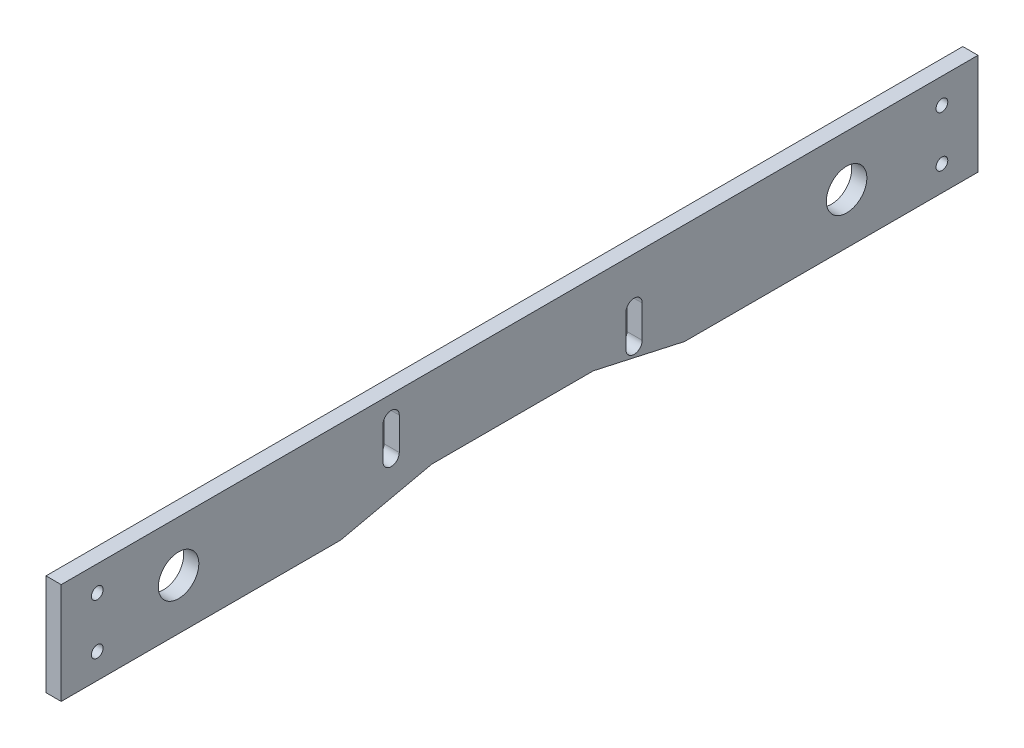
ISO-10303-21;
HEADER;
FILE_DESCRIPTION(('STEP AP214'),'2;1');
FILE_NAME('part.step','',(''),(''),'','','');
FILE_SCHEMA(('AUTOMOTIVE_DESIGN { 1 0 10303 214 1 1 1 1 }'));
ENDSEC;
DATA;
#1=APPLICATION_CONTEXT('core data for automotive mechanical design processes');
#2=APPLICATION_PROTOCOL_DEFINITION('international standard','automotive_design',2000,#1);
#3=PRODUCT_CONTEXT('',#1,'mechanical');
#4=PRODUCT('Part','Part','',(#3));
#5=PRODUCT_RELATED_PRODUCT_CATEGORY('part','',(#4));
#6=PRODUCT_DEFINITION_FORMATION('','',#4);
#7=PRODUCT_DEFINITION_CONTEXT('part definition',#1,'design');
#8=PRODUCT_DEFINITION('design','',#6,#7);
#9=PRODUCT_DEFINITION_SHAPE('','',#8);
#10=(LENGTH_UNIT() NAMED_UNIT(*) SI_UNIT(.MILLI.,.METRE.));
#11=(NAMED_UNIT(*) PLANE_ANGLE_UNIT() SI_UNIT($,.RADIAN.));
#12=(NAMED_UNIT(*) SI_UNIT($,.STERADIAN.) SOLID_ANGLE_UNIT());
#13=UNCERTAINTY_MEASURE_WITH_UNIT(LENGTH_MEASURE(1.E-05),#10,'distance_accuracy_value','');
#14=(GEOMETRIC_REPRESENTATION_CONTEXT(3) GLOBAL_UNCERTAINTY_ASSIGNED_CONTEXT((#13)) GLOBAL_UNIT_ASSIGNED_CONTEXT((#10,
#11,#12)) REPRESENTATION_CONTEXT('',''));
#15=CARTESIAN_POINT('',(0.,0.,0.));
#16=DIRECTION('',(0.,0.,1.));
#17=DIRECTION('',(1.,0.,0.));
#18=AXIS2_PLACEMENT_3D('',#15,#16,#17);
#19=CARTESIAN_POINT('',(4.7625,-15.875,143.79575));
#20=DIRECTION('',(0.,1.,0.));
#21=DIRECTION('',(0.,0.,1.));
#22=AXIS2_PLACEMENT_3D('',#19,#20,#21);
#23=PLANE('',#22);
#24=DIRECTION('',(0.,0.,-1.));
#25=VECTOR('',#24,1.);
#26=CARTESIAN_POINT('',(4.7625,-15.875,143.79575));
#27=LINE('',#26,#25);
#28=CARTESIAN_POINT('',(4.7625,-15.875,-51.78425));
#29=VERTEX_POINT('',#28);
#30=CARTESIAN_POINT('',(4.7625,-15.875,-143.79575));
#31=VERTEX_POINT('',#30);
#32=EDGE_CURVE('E176',#29,#31,#27,.T.);
#33=ORIENTED_EDGE('',*,*,#32,.F.);
#34=DIRECTION('',(-1.,0.,0.));
#35=VECTOR('',#34,1.);
#36=CARTESIAN_POINT('',(4.7625,-15.875,-51.78425));
#37=LINE('',#36,#35);
#38=CARTESIAN_POINT('',(0.,-15.875,-51.78425));
#39=VERTEX_POINT('',#38);
#40=EDGE_CURVE('E216',#29,#39,#37,.T.);
#41=ORIENTED_EDGE('',*,*,#40,.T.);
#42=DIRECTION('',(0.,0.,-1.));
#43=VECTOR('',#42,1.);
#44=CARTESIAN_POINT('',(0.,-15.875,143.79575));
#45=LINE('',#44,#43);
#46=CARTESIAN_POINT('',(0.,-15.875,-143.79575));
#47=VERTEX_POINT('',#46);
#48=EDGE_CURVE('E192',#39,#47,#45,.T.);
#49=ORIENTED_EDGE('',*,*,#48,.T.);
#50=DIRECTION('',(-1.,0.,0.));
#51=VECTOR('',#50,1.);
#52=CARTESIAN_POINT('',(4.7625,-15.875,-143.79575));
#53=LINE('',#52,#51);
#54=EDGE_CURVE('E175',#31,#47,#53,.T.);
#55=ORIENTED_EDGE('',*,*,#54,.F.);
#56=EDGE_LOOP('',(#33,#41,#49,#55));
#57=FACE_BOUND('',#56,.T.);
#58=ADVANCED_FACE('F39',(#57),#23,.F.);
#59=CARTESIAN_POINT('',(4.7625,-15.875,-143.79575));
#60=DIRECTION('',(0.,0.,1.));
#61=DIRECTION('',(1.,0.,0.));
#62=AXIS2_PLACEMENT_3D('',#59,#60,#61);
#63=PLANE('',#62);
#64=DIRECTION('',(0.,1.,0.));
#65=VECTOR('',#64,1.);
#66=CARTESIAN_POINT('',(0.,-15.875,-143.79575));
#67=LINE('',#66,#65);
#68=CARTESIAN_POINT('',(0.,15.875,-143.79575));
#69=VERTEX_POINT('',#68);
#70=EDGE_CURVE('E184',#47,#69,#67,.T.);
#71=ORIENTED_EDGE('',*,*,#70,.T.);
#72=DIRECTION('',(-1.,0.,0.));
#73=VECTOR('',#72,1.);
#74=CARTESIAN_POINT('',(4.7625,15.875,-143.79575));
#75=LINE('',#74,#73);
#76=CARTESIAN_POINT('',(4.7625,15.875,-143.79575));
#77=VERTEX_POINT('',#76);
#78=EDGE_CURVE('E11',#77,#69,#75,.T.);
#79=ORIENTED_EDGE('',*,*,#78,.F.);
#80=DIRECTION('',(0.,1.,0.));
#81=VECTOR('',#80,1.);
#82=CARTESIAN_POINT('',(4.7625,-15.875,-143.79575));
#83=LINE('',#82,#81);
#84=EDGE_CURVE('E193',#31,#77,#83,.T.);
#85=ORIENTED_EDGE('',*,*,#84,.F.);
#86=ORIENTED_EDGE('',*,*,#54,.T.);
#87=EDGE_LOOP('',(#71,#79,#85,#86));
#88=FACE_BOUND('',#87,.T.);
#89=ADVANCED_FACE('F41',(#88),#63,.F.);
#90=CARTESIAN_POINT('',(4.7625,15.875,143.79575));
#91=DIRECTION('',(0.,-1.,0.));
#92=DIRECTION('',(0.,0.,-1.));
#93=AXIS2_PLACEMENT_3D('',#90,#91,#92);
#94=PLANE('',#93);
#95=DIRECTION('',(0.,0.,1.));
#96=VECTOR('',#95,1.);
#97=CARTESIAN_POINT('',(0.,15.875,143.79575));
#98=LINE('',#97,#96);
#99=CARTESIAN_POINT('',(0.,15.875,143.79575));
#100=VERTEX_POINT('',#99);
#101=EDGE_CURVE('E187',#69,#100,#98,.T.);
#102=ORIENTED_EDGE('',*,*,#101,.T.);
#103=DIRECTION('',(-1.,0.,0.));
#104=VECTOR('',#103,1.);
#105=CARTESIAN_POINT('',(4.7625,15.875,143.79575));
#106=LINE('',#105,#104);
#107=CARTESIAN_POINT('',(4.7625,15.875,143.79575));
#108=VERTEX_POINT('',#107);
#109=EDGE_CURVE('E47',#108,#100,#106,.T.);
#110=ORIENTED_EDGE('',*,*,#109,.F.);
#111=DIRECTION('',(0.,0.,1.));
#112=VECTOR('',#111,1.);
#113=CARTESIAN_POINT('',(4.7625,15.875,143.79575));
#114=LINE('',#113,#112);
#115=EDGE_CURVE('E320',#77,#108,#114,.T.);
#116=ORIENTED_EDGE('',*,*,#115,.F.);
#117=ORIENTED_EDGE('',*,*,#78,.T.);
#118=EDGE_LOOP('',(#102,#110,#116,#117));
#119=FACE_BOUND('',#118,.T.);
#120=ADVANCED_FACE('F323',(#119),#94,.F.);
#121=CARTESIAN_POINT('',(4.7625,-15.875,143.79575));
#122=DIRECTION('',(0.,0.,-1.));
#123=DIRECTION('',(-1.,0.,0.));
#124=AXIS2_PLACEMENT_3D('',#121,#122,#123);
#125=PLANE('',#124);
#126=DIRECTION('',(0.,-1.,0.));
#127=VECTOR('',#126,1.);
#128=CARTESIAN_POINT('',(0.,-15.875,143.79575));
#129=LINE('',#128,#127);
#130=CARTESIAN_POINT('',(0.,-15.875,143.79575));
#131=VERTEX_POINT('',#130);
#132=EDGE_CURVE('E190',#100,#131,#129,.T.);
#133=ORIENTED_EDGE('',*,*,#132,.T.);
#134=DIRECTION('',(-1.,0.,0.));
#135=VECTOR('',#134,1.);
#136=CARTESIAN_POINT('',(4.7625,-15.875,143.79575));
#137=LINE('',#136,#135);
#138=CARTESIAN_POINT('',(4.7625,-15.875,143.79575));
#139=VERTEX_POINT('',#138);
#140=EDGE_CURVE('E179',#139,#131,#137,.T.);
#141=ORIENTED_EDGE('',*,*,#140,.F.);
#142=DIRECTION('',(0.,-1.,0.));
#143=VECTOR('',#142,1.);
#144=CARTESIAN_POINT('',(4.7625,-15.875,143.79575));
#145=LINE('',#144,#143);
#146=EDGE_CURVE('E173',#108,#139,#145,.T.);
#147=ORIENTED_EDGE('',*,*,#146,.F.);
#148=ORIENTED_EDGE('',*,*,#109,.T.);
#149=EDGE_LOOP('',(#133,#141,#147,#148));
#150=FACE_BOUND('',#149,.T.);
#151=ADVANCED_FACE('F199',(#150),#125,.F.);
#152=CARTESIAN_POINT('',(0.,-15.875,56.1657500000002));
#153=VERTEX_POINT('',#152);
#154=EDGE_CURVE('E168',#131,#153,#45,.T.);
#155=ORIENTED_EDGE('',*,*,#154,.T.);
#156=DIRECTION('',(-1.,0.,0.));
#157=VECTOR('',#156,1.);
#158=CARTESIAN_POINT('',(4.7625,-15.875,56.16575));
#159=LINE('',#158,#157);
#160=CARTESIAN_POINT('',(4.7625,-15.875,56.16575));
#161=VERTEX_POINT('',#160);
#162=EDGE_CURVE('E54',#161,#153,#159,.T.);
#163=ORIENTED_EDGE('',*,*,#162,.F.);
#164=EDGE_CURVE('E166',#139,#161,#27,.T.);
#165=ORIENTED_EDGE('',*,*,#164,.F.);
#166=ORIENTED_EDGE('',*,*,#140,.T.);
#167=EDGE_LOOP('',(#155,#163,#165,#166));
#168=FACE_BOUND('',#167,.T.);
#169=ADVANCED_FACE('F164',(#168),#23,.F.);
#170=CARTESIAN_POINT('',(4.7625,0.,0.));
#171=DIRECTION('',(-1.,0.,0.));
#172=DIRECTION('',(0.,0.,1.));
#173=AXIS2_PLACEMENT_3D('',#170,#171,#172);
#174=PLANE('',#173);
#175=DIRECTION('',(0.,1.,0.));
#176=VECTOR('',#175,1.);
#177=CARTESIAN_POINT('',(4.7625,-1.27000000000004,42.84345));
#178=LINE('',#177,#176);
#179=CARTESIAN_POINT('',(4.7625,-1.27000000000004,42.84345));
#180=VERTEX_POINT('',#179);
#181=CARTESIAN_POINT('',(4.7625,8.88999999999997,42.84345));
#182=VERTEX_POINT('',#181);
#183=EDGE_CURVE('E231',#180,#182,#178,.T.);
#184=ORIENTED_EDGE('',*,*,#183,.T.);
#185=CARTESIAN_POINT('',(4.7625,8.88999999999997,40.29075));
#186=DIRECTION('',(-1.,0.,0.));
#187=DIRECTION('',(0.,0.,1.));
#188=AXIS2_PLACEMENT_3D('',#185,#186,#187);
#189=CIRCLE('',#188,2.55269999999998);
#190=CARTESIAN_POINT('',(4.7625,8.88999999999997,37.7380500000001));
#191=VERTEX_POINT('',#190);
#192=EDGE_CURVE('E223',#182,#191,#189,.T.);
#193=ORIENTED_EDGE('',*,*,#192,.T.);
#194=DIRECTION('',(0.,-1.,0.));
#195=VECTOR('',#194,1.);
#196=CARTESIAN_POINT('',(4.7625,8.88999999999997,37.7380500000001));
#197=LINE('',#196,#195);
#198=CARTESIAN_POINT('',(4.7625,-1.27000000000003,37.7380500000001));
#199=VERTEX_POINT('',#198);
#200=EDGE_CURVE('E226',#191,#199,#197,.T.);
#201=ORIENTED_EDGE('',*,*,#200,.T.);
#202=CARTESIAN_POINT('',(4.7625,-1.27000000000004,40.29075));
#203=DIRECTION('',(-1.,0.,0.));
#204=DIRECTION('',(0.,0.,1.));
#205=AXIS2_PLACEMENT_3D('',#202,#203,#204);
#206=CIRCLE('',#205,2.55269999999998);
#207=EDGE_CURVE('E62',#199,#180,#206,.T.);
#208=ORIENTED_EDGE('',*,*,#207,.T.);
#209=EDGE_LOOP('',(#184,#193,#201,#208));
#210=FACE_BOUND('',#209,.T.);
#211=DIRECTION('',(0.,1.,0.));
#212=VECTOR('',#211,1.);
#213=CARTESIAN_POINT('',(4.7625,-8.89000000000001,-33.35655));
#214=LINE('',#213,#212);
#215=CARTESIAN_POINT('',(4.7625,-8.89000000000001,-33.35655));
#216=VERTEX_POINT('',#215);
#217=CARTESIAN_POINT('',(4.7625,1.26999999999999,-33.35655));
#218=VERTEX_POINT('',#217);
#219=EDGE_CURVE('E265',#216,#218,#214,.T.);
#220=ORIENTED_EDGE('',*,*,#219,.T.);
#221=CARTESIAN_POINT('',(4.7625,1.26999999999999,-35.90925));
#222=DIRECTION('',(-1.,0.,0.));
#223=DIRECTION('',(0.,0.,1.));
#224=AXIS2_PLACEMENT_3D('',#221,#222,#223);
#225=CIRCLE('',#224,2.55269999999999);
#226=CARTESIAN_POINT('',(4.7625,1.26999999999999,-38.46195));
#227=VERTEX_POINT('',#226);
#228=EDGE_CURVE('E255',#218,#227,#225,.T.);
#229=ORIENTED_EDGE('',*,*,#228,.T.);
#230=DIRECTION('',(0.,-1.,0.));
#231=VECTOR('',#230,1.);
#232=CARTESIAN_POINT('',(4.7625,1.26999999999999,-38.46195));
#233=LINE('',#232,#231);
#234=CARTESIAN_POINT('',(4.7625,-8.89000000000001,-38.46195));
#235=VERTEX_POINT('',#234);
#236=EDGE_CURVE('E258',#227,#235,#233,.T.);
#237=ORIENTED_EDGE('',*,*,#236,.T.);
#238=CARTESIAN_POINT('',(4.7625,-8.89000000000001,-35.90925));
#239=DIRECTION('',(-1.,0.,0.));
#240=DIRECTION('',(0.,0.,1.));
#241=AXIS2_PLACEMENT_3D('',#238,#239,#240);
#242=CIRCLE('',#241,2.55269999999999);
#243=EDGE_CURVE('E262',#235,#216,#242,.T.);
#244=ORIENTED_EDGE('',*,*,#243,.T.);
#245=EDGE_LOOP('',(#220,#229,#237,#244));
#246=FACE_BOUND('',#245,.T.);
#247=CARTESIAN_POINT('',(4.7625,7.93750000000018,132.4737));
#248=DIRECTION('',(-1.,0.,0.));
#249=DIRECTION('',(0.,0.,-1.));
#250=AXIS2_PLACEMENT_3D('',#247,#248,#249);
#251=CIRCLE('',#250,1.84149999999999);
#252=CARTESIAN_POINT('',(4.7625,7.93750000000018,134.3152));
#253=VERTEX_POINT('',#252);
#254=EDGE_CURVE('E298',#253,#253,#251,.T.);
#255=ORIENTED_EDGE('',*,*,#254,.T.);
#256=EDGE_LOOP('',(#255));
#257=FACE_BOUND('',#256,.T.);
#258=CARTESIAN_POINT('',(4.7625,-7.93749999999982,132.4737));
#259=DIRECTION('',(-1.,0.,0.));
#260=DIRECTION('',(0.,0.,-1.));
#261=AXIS2_PLACEMENT_3D('',#258,#259,#260);
#262=CIRCLE('',#261,1.84149999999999);
#263=CARTESIAN_POINT('',(4.7625,-7.93749999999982,134.3152));
#264=VERTEX_POINT('',#263);
#265=EDGE_CURVE('E292',#264,#264,#262,.T.);
#266=ORIENTED_EDGE('',*,*,#265,.T.);
#267=EDGE_LOOP('',(#266));
#268=FACE_BOUND('',#267,.T.);
#269=CARTESIAN_POINT('',(4.7625,-7.93749999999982,-132.4737));
#270=DIRECTION('',(-1.,0.,0.));
#271=DIRECTION('',(0.,0.,1.));
#272=AXIS2_PLACEMENT_3D('',#269,#270,#271);
#273=CIRCLE('',#272,1.84149999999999);
#274=CARTESIAN_POINT('',(4.7625,-7.93749999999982,-130.6322));
#275=VERTEX_POINT('',#274);
#276=EDGE_CURVE('E285',#275,#275,#273,.T.);
#277=ORIENTED_EDGE('',*,*,#276,.T.);
#278=EDGE_LOOP('',(#277));
#279=FACE_BOUND('',#278,.T.);
#280=CARTESIAN_POINT('',(4.7625,7.93750000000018,-132.4737));
#281=DIRECTION('',(-1.,0.,0.));
#282=DIRECTION('',(0.,0.,1.));
#283=AXIS2_PLACEMENT_3D('',#280,#281,#282);
#284=CIRCLE('',#283,1.84149999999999);
#285=CARTESIAN_POINT('',(4.7625,7.93750000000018,-130.6322));
#286=VERTEX_POINT('',#285);
#287=EDGE_CURVE('E303',#286,#286,#284,.T.);
#288=ORIENTED_EDGE('',*,*,#287,.T.);
#289=EDGE_LOOP('',(#288));
#290=FACE_BOUND('',#289,.T.);
#291=CARTESIAN_POINT('',(4.7625,0.,106.96575));
#292=DIRECTION('',(1.,0.,0.));
#293=DIRECTION('',(0.,0.,-1.));
#294=AXIS2_PLACEMENT_3D('',#291,#292,#293);
#295=CIRCLE('',#294,6.35);
#296=CARTESIAN_POINT('',(4.7625,0.,100.61575));
#297=VERTEX_POINT('',#296);
#298=EDGE_CURVE('E311',#297,#297,#295,.T.);
#299=ORIENTED_EDGE('',*,*,#298,.F.);
#300=EDGE_LOOP('',(#299));
#301=FACE_BOUND('',#300,.T.);
#302=CARTESIAN_POINT('',(4.7625,0.,-102.58425));
#303=DIRECTION('',(1.,0.,0.));
#304=DIRECTION('',(0.,0.,-1.));
#305=AXIS2_PLACEMENT_3D('',#302,#303,#304);
#306=CIRCLE('',#305,6.35);
#307=CARTESIAN_POINT('',(4.7625,0.,-108.93425));
#308=VERTEX_POINT('',#307);
#309=EDGE_CURVE('E306',#308,#308,#306,.T.);
#310=ORIENTED_EDGE('',*,*,#309,.F.);
#311=EDGE_LOOP('',(#310));
#312=FACE_BOUND('',#311,.T.);
#313=DIRECTION('',(0.,0.,-1.));
#314=VECTOR('',#313,1.);
#315=CARTESIAN_POINT('',(4.7625,-9.52500000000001,-23.1412510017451));
#316=LINE('',#315,#314);
#317=CARTESIAN_POINT('',(4.7625,-9.52500000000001,27.5227510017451));
#318=VERTEX_POINT('',#317);
#319=CARTESIAN_POINT('',(4.7625,-9.52500000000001,-23.1412510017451));
#320=VERTEX_POINT('',#319);
#321=EDGE_CURVE('E158',#318,#320,#316,.T.);
#322=ORIENTED_EDGE('',*,*,#321,.T.);
#323=DIRECTION('',(0.,-0.216439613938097,-0.976296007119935));
#324=VECTOR('',#323,1.);
#325=CARTESIAN_POINT('',(4.7625,-15.875,-51.78425));
#326=LINE('',#325,#324);
#327=EDGE_CURVE('E169',#320,#29,#326,.T.);
#328=ORIENTED_EDGE('',*,*,#327,.T.);
#329=ORIENTED_EDGE('',*,*,#32,.T.);
#330=ORIENTED_EDGE('',*,*,#84,.T.);
#331=ORIENTED_EDGE('',*,*,#115,.T.);
#332=ORIENTED_EDGE('',*,*,#146,.T.);
#333=ORIENTED_EDGE('',*,*,#164,.T.);
#334=DIRECTION('',(0.,0.216439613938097,-0.976296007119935));
#335=VECTOR('',#334,1.);
#336=CARTESIAN_POINT('',(4.7625,-9.52500000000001,27.5227510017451));
#337=LINE('',#336,#335);
#338=EDGE_CURVE('E151',#161,#318,#337,.T.);
#339=ORIENTED_EDGE('',*,*,#338,.T.);
#340=EDGE_LOOP('',(#322,#328,#329,#330,#331,#332,#333,#339));
#341=FACE_BOUND('',#340,.T.);
#342=ADVANCED_FACE('F171',(#210,#246,#257,#268,#279,#290,#301,#312,#341),#174,.F.);
#343=CARTESIAN_POINT('',(0.,0.,0.));
#344=DIRECTION('',(-1.,0.,0.));
#345=DIRECTION('',(0.,0.,1.));
#346=AXIS2_PLACEMENT_3D('',#343,#344,#345);
#347=PLANE('',#346);
#348=DIRECTION('',(0.,-0.216439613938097,-0.976296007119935));
#349=VECTOR('',#348,1.);
#350=CARTESIAN_POINT('',(0.,-15.875,-51.78425));
#351=LINE('',#350,#349);
#352=CARTESIAN_POINT('',(0.,-9.52500000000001,-23.1412510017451));
#353=VERTEX_POINT('',#352);
#354=EDGE_CURVE('E159',#353,#39,#351,.T.);
#355=ORIENTED_EDGE('',*,*,#354,.F.);
#356=DIRECTION('',(0.,0.,-1.));
#357=VECTOR('',#356,1.);
#358=CARTESIAN_POINT('',(0.,-9.52500000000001,-23.1412510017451));
#359=LINE('',#358,#357);
#360=CARTESIAN_POINT('',(0.,-9.52500000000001,27.5227510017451));
#361=VERTEX_POINT('',#360);
#362=EDGE_CURVE('E209',#361,#353,#359,.T.);
#363=ORIENTED_EDGE('',*,*,#362,.F.);
#364=DIRECTION('',(0.,0.216439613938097,-0.976296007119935));
#365=VECTOR('',#364,1.);
#366=CARTESIAN_POINT('',(0.,-9.52500000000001,27.5227510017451));
#367=LINE('',#366,#365);
#368=EDGE_CURVE('E207',#153,#361,#367,.T.);
#369=ORIENTED_EDGE('',*,*,#368,.F.);
#370=ORIENTED_EDGE('',*,*,#154,.F.);
#371=ORIENTED_EDGE('',*,*,#132,.F.);
#372=ORIENTED_EDGE('',*,*,#101,.F.);
#373=ORIENTED_EDGE('',*,*,#70,.F.);
#374=ORIENTED_EDGE('',*,*,#48,.F.);
#375=EDGE_LOOP('',(#355,#363,#369,#370,#371,#372,#373,#374));
#376=FACE_BOUND('',#375,.T.);
#377=CARTESIAN_POINT('',(0.,8.88999999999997,40.29075));
#378=DIRECTION('',(-1.,0.,0.));
#379=DIRECTION('',(0.,0.,1.));
#380=AXIS2_PLACEMENT_3D('',#377,#378,#379);
#381=CIRCLE('',#380,2.55269999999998);
#382=CARTESIAN_POINT('',(0.,8.88999999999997,42.84345));
#383=VERTEX_POINT('',#382);
#384=CARTESIAN_POINT('',(0.,8.88999999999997,37.7380500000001));
#385=VERTEX_POINT('',#384);
#386=EDGE_CURVE('E235',#383,#385,#381,.T.);
#387=ORIENTED_EDGE('',*,*,#386,.F.);
#388=DIRECTION('',(0.,1.,0.));
#389=VECTOR('',#388,1.);
#390=CARTESIAN_POINT('',(0.,-1.27000000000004,42.84345));
#391=LINE('',#390,#389);
#392=CARTESIAN_POINT('',(0.,-1.27000000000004,42.84345));
#393=VERTEX_POINT('',#392);
#394=EDGE_CURVE('E227',#393,#383,#391,.T.);
#395=ORIENTED_EDGE('',*,*,#394,.F.);
#396=CARTESIAN_POINT('',(0.,-1.27000000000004,40.29075));
#397=DIRECTION('',(-1.,0.,0.));
#398=DIRECTION('',(0.,0.,1.));
#399=AXIS2_PLACEMENT_3D('',#396,#397,#398);
#400=CIRCLE('',#399,2.55269999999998);
#401=CARTESIAN_POINT('',(0.,-1.27000000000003,37.7380500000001));
#402=VERTEX_POINT('',#401);
#403=EDGE_CURVE('E241',#402,#393,#400,.T.);
#404=ORIENTED_EDGE('',*,*,#403,.F.);
#405=DIRECTION('',(0.,-1.,0.));
#406=VECTOR('',#405,1.);
#407=CARTESIAN_POINT('',(0.,8.88999999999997,37.7380500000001));
#408=LINE('',#407,#406);
#409=EDGE_CURVE('E237',#385,#402,#408,.T.);
#410=ORIENTED_EDGE('',*,*,#409,.F.);
#411=EDGE_LOOP('',(#387,#395,#404,#410));
#412=FACE_BOUND('',#411,.T.);
#413=CARTESIAN_POINT('',(0.,1.26999999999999,-35.90925));
#414=DIRECTION('',(-1.,0.,0.));
#415=DIRECTION('',(0.,0.,1.));
#416=AXIS2_PLACEMENT_3D('',#413,#414,#415);
#417=CIRCLE('',#416,2.55269999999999);
#418=CARTESIAN_POINT('',(0.,1.26999999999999,-33.35655));
#419=VERTEX_POINT('',#418);
#420=CARTESIAN_POINT('',(0.,1.26999999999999,-38.46195));
#421=VERTEX_POINT('',#420);
#422=EDGE_CURVE('E219',#419,#421,#417,.T.);
#423=ORIENTED_EDGE('',*,*,#422,.F.);
#424=DIRECTION('',(0.,1.,0.));
#425=VECTOR('',#424,1.);
#426=CARTESIAN_POINT('',(0.,-8.89000000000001,-33.35655));
#427=LINE('',#426,#425);
#428=CARTESIAN_POINT('',(0.,-8.89000000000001,-33.35655));
#429=VERTEX_POINT('',#428);
#430=EDGE_CURVE('E259',#429,#419,#427,.T.);
#431=ORIENTED_EDGE('',*,*,#430,.F.);
#432=CARTESIAN_POINT('',(0.,-8.89000000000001,-35.90925));
#433=DIRECTION('',(-1.,0.,0.));
#434=DIRECTION('',(0.,0.,1.));
#435=AXIS2_PLACEMENT_3D('',#432,#433,#434);
#436=CIRCLE('',#435,2.55269999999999);
#437=CARTESIAN_POINT('',(0.,-8.89000000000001,-38.46195));
#438=VERTEX_POINT('',#437);
#439=EDGE_CURVE('E273',#438,#429,#436,.T.);
#440=ORIENTED_EDGE('',*,*,#439,.F.);
#441=DIRECTION('',(0.,-1.,0.));
#442=VECTOR('',#441,1.);
#443=CARTESIAN_POINT('',(0.,1.26999999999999,-38.46195));
#444=LINE('',#443,#442);
#445=EDGE_CURVE('E270',#421,#438,#444,.T.);
#446=ORIENTED_EDGE('',*,*,#445,.F.);
#447=EDGE_LOOP('',(#423,#431,#440,#446));
#448=FACE_BOUND('',#447,.T.);
#449=CARTESIAN_POINT('',(0.,7.93750000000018,132.4737));
#450=DIRECTION('',(-1.,0.,0.));
#451=DIRECTION('',(0.,0.,-1.));
#452=AXIS2_PLACEMENT_3D('',#449,#450,#451);
#453=CIRCLE('',#452,1.84149999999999);
#454=CARTESIAN_POINT('',(0.,7.93750000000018,134.3152));
#455=VERTEX_POINT('',#454);
#456=EDGE_CURVE('E248',#455,#455,#453,.T.);
#457=ORIENTED_EDGE('',*,*,#456,.F.);
#458=EDGE_LOOP('',(#457));
#459=FACE_BOUND('',#458,.T.);
#460=CARTESIAN_POINT('',(0.,-7.93749999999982,132.4737));
#461=DIRECTION('',(-1.,0.,0.));
#462=DIRECTION('',(0.,0.,-1.));
#463=AXIS2_PLACEMENT_3D('',#460,#461,#462);
#464=CIRCLE('',#463,1.84149999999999);
#465=CARTESIAN_POINT('',(0.,-7.93749999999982,134.3152));
#466=VERTEX_POINT('',#465);
#467=EDGE_CURVE('E295',#466,#466,#464,.T.);
#468=ORIENTED_EDGE('',*,*,#467,.F.);
#469=EDGE_LOOP('',(#468));
#470=FACE_BOUND('',#469,.T.);
#471=CARTESIAN_POINT('',(0.,-7.93749999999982,-132.4737));
#472=DIRECTION('',(-1.,0.,0.));
#473=DIRECTION('',(0.,0.,1.));
#474=AXIS2_PLACEMENT_3D('',#471,#472,#473);
#475=CIRCLE('',#474,1.84149999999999);
#476=CARTESIAN_POINT('',(0.,-7.93749999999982,-130.6322));
#477=VERTEX_POINT('',#476);
#478=EDGE_CURVE('E289',#477,#477,#475,.T.);
#479=ORIENTED_EDGE('',*,*,#478,.F.);
#480=EDGE_LOOP('',(#479));
#481=FACE_BOUND('',#480,.T.);
#482=CARTESIAN_POINT('',(0.,7.93750000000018,-132.4737));
#483=DIRECTION('',(-1.,0.,0.));
#484=DIRECTION('',(0.,0.,1.));
#485=AXIS2_PLACEMENT_3D('',#482,#483,#484);
#486=CIRCLE('',#485,1.84149999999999);
#487=CARTESIAN_POINT('',(0.,7.93750000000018,-130.6322));
#488=VERTEX_POINT('',#487);
#489=EDGE_CURVE('E288',#488,#488,#486,.T.);
#490=ORIENTED_EDGE('',*,*,#489,.F.);
#491=EDGE_LOOP('',(#490));
#492=FACE_BOUND('',#491,.T.);
#493=CARTESIAN_POINT('',(0.,0.,106.96575));
#494=DIRECTION('',(1.,0.,0.));
#495=DIRECTION('',(0.,0.,-1.));
#496=AXIS2_PLACEMENT_3D('',#493,#494,#495);
#497=CIRCLE('',#496,6.35);
#498=CARTESIAN_POINT('',(0.,0.,100.61575));
#499=VERTEX_POINT('',#498);
#500=EDGE_CURVE('E188',#499,#499,#497,.T.);
#501=ORIENTED_EDGE('',*,*,#500,.T.);
#502=EDGE_LOOP('',(#501));
#503=FACE_BOUND('',#502,.T.);
#504=CARTESIAN_POINT('',(0.,0.,-102.58425));
#505=DIRECTION('',(1.,0.,0.));
#506=DIRECTION('',(0.,0.,-1.));
#507=AXIS2_PLACEMENT_3D('',#504,#505,#506);
#508=CIRCLE('',#507,6.35);
#509=CARTESIAN_POINT('',(0.,0.,-108.93425));
#510=VERTEX_POINT('',#509);
#511=EDGE_CURVE('E314',#510,#510,#508,.T.);
#512=ORIENTED_EDGE('',*,*,#511,.T.);
#513=EDGE_LOOP('',(#512));
#514=FACE_BOUND('',#513,.T.);
#515=ADVANCED_FACE('F203',(#376,#412,#448,#459,#470,#481,#492,#503,#514),#347,.T.);
#516=CARTESIAN_POINT('',(0.,0.,-102.58425));
#517=DIRECTION('',(1.,0.,0.));
#518=DIRECTION('',(0.,0.,-1.));
#519=AXIS2_PLACEMENT_3D('',#516,#517,#518);
#520=CYLINDRICAL_SURFACE('',#519,6.35);
#521=CARTESIAN_POINT('',(0.,0.,-108.93425));
#522=CARTESIAN_POINT('',(0.049609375,0.,-108.93425));
#523=CARTESIAN_POINT('',(0.09921875,0.,-108.93425));
#524=CARTESIAN_POINT('',(0.1984375,0.,-108.93425));
#525=CARTESIAN_POINT('',(0.248046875,0.,-108.93425));
#526=CARTESIAN_POINT('',(0.347265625,0.,-108.93425));
#527=CARTESIAN_POINT('',(0.396875,0.,-108.93425));
#528=CARTESIAN_POINT('',(0.49609375,0.,-108.93425));
#529=CARTESIAN_POINT('',(0.545703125,0.,-108.93425));
#530=CARTESIAN_POINT('',(0.644921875,0.,-108.93425));
#531=CARTESIAN_POINT('',(0.69453125,0.,-108.93425));
#532=CARTESIAN_POINT('',(0.79375,0.,-108.93425));
#533=CARTESIAN_POINT('',(0.843359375,0.,-108.93425));
#534=CARTESIAN_POINT('',(0.942578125,0.,-108.93425));
#535=CARTESIAN_POINT('',(0.9921875,0.,-108.93425));
#536=CARTESIAN_POINT('',(1.09140625,0.,-108.93425));
#537=CARTESIAN_POINT('',(1.141015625,0.,-108.93425));
#538=CARTESIAN_POINT('',(1.240234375,0.,-108.93425));
#539=CARTESIAN_POINT('',(1.28984375,0.,-108.93425));
#540=CARTESIAN_POINT('',(1.3890625,0.,-108.93425));
#541=CARTESIAN_POINT('',(1.438671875,0.,-108.93425));
#542=CARTESIAN_POINT('',(1.537890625,0.,-108.93425));
#543=CARTESIAN_POINT('',(1.5875,0.,-108.93425));
#544=CARTESIAN_POINT('',(1.68671875,0.,-108.93425));
#545=CARTESIAN_POINT('',(1.736328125,0.,-108.93425));
#546=CARTESIAN_POINT('',(1.835546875,0.,-108.93425));
#547=CARTESIAN_POINT('',(1.88515625,0.,-108.93425));
#548=CARTESIAN_POINT('',(1.984375,0.,-108.93425));
#549=CARTESIAN_POINT('',(2.033984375,0.,-108.93425));
#550=CARTESIAN_POINT('',(2.133203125,0.,-108.93425));
#551=CARTESIAN_POINT('',(2.1828125,0.,-108.93425));
#552=CARTESIAN_POINT('',(2.28203125,0.,-108.93425));
#553=CARTESIAN_POINT('',(2.331640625,0.,-108.93425));
#554=CARTESIAN_POINT('',(2.430859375,0.,-108.93425));
#555=CARTESIAN_POINT('',(2.48046875,0.,-108.93425));
#556=CARTESIAN_POINT('',(2.5796875,0.,-108.93425));
#557=CARTESIAN_POINT('',(2.629296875,0.,-108.93425));
#558=CARTESIAN_POINT('',(2.728515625,0.,-108.93425));
#559=CARTESIAN_POINT('',(2.778125,0.,-108.93425));
#560=CARTESIAN_POINT('',(2.87734375,0.,-108.93425));
#561=CARTESIAN_POINT('',(2.926953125,0.,-108.93425));
#562=CARTESIAN_POINT('',(3.026171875,0.,-108.93425));
#563=CARTESIAN_POINT('',(3.07578125,0.,-108.93425));
#564=CARTESIAN_POINT('',(3.175,0.,-108.93425));
#565=CARTESIAN_POINT('',(3.224609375,0.,-108.93425));
#566=CARTESIAN_POINT('',(3.323828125,0.,-108.93425));
#567=CARTESIAN_POINT('',(3.3734375,0.,-108.93425));
#568=CARTESIAN_POINT('',(3.47265625,0.,-108.93425));
#569=CARTESIAN_POINT('',(3.522265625,0.,-108.93425));
#570=CARTESIAN_POINT('',(3.621484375,0.,-108.93425));
#571=CARTESIAN_POINT('',(3.67109375,0.,-108.93425));
#572=CARTESIAN_POINT('',(3.7703125,0.,-108.93425));
#573=CARTESIAN_POINT('',(3.819921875,0.,-108.93425));
#574=CARTESIAN_POINT('',(3.919140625,0.,-108.93425));
#575=CARTESIAN_POINT('',(3.96875,0.,-108.93425));
#576=CARTESIAN_POINT('',(4.06796875,0.,-108.93425));
#577=CARTESIAN_POINT('',(4.117578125,0.,-108.93425));
#578=CARTESIAN_POINT('',(4.216796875,0.,-108.93425));
#579=CARTESIAN_POINT('',(4.26640625,0.,-108.93425));
#580=CARTESIAN_POINT('',(4.365625,0.,-108.93425));
#581=CARTESIAN_POINT('',(4.415234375,0.,-108.93425));
#582=CARTESIAN_POINT('',(4.514453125,0.,-108.93425));
#583=CARTESIAN_POINT('',(4.5640625,0.,-108.93425));
#584=CARTESIAN_POINT('',(4.66328125,0.,-108.93425));
#585=CARTESIAN_POINT('',(4.712890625,0.,-108.93425));
#586=CARTESIAN_POINT('',(4.7625,0.,-108.93425));
#587=B_SPLINE_CURVE_WITH_KNOTS('',3,(#521,#522,#523,#524,#525,#526,#527,#528,#529,#530,#531,
#532,#533,#534,#535,#536,#537,#538,#539,#540,#541,#542,#543,#544,#545,#546,#547,#548,#549,#550,
#551,#552,#553,#554,#555,#556,#557,#558,#559,#560,#561,#562,#563,#564,#565,#566,#567,#568,#569,
#570,#571,#572,#573,#574,#575,#576,#577,#578,#579,#580,#581,#582,#583,#584,#585,#586),
.UNSPECIFIED.,.F.,.F.,(4,2,2,2,2,2,2,2,2,2,2,2,2,2,2,2,2,2,2,2,2,2,2,2,2,2,2,2,2,2,2,2,4),(0.,
0.148828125,0.29765625,0.446484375,0.5953125,0.744140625,0.89296875,1.041796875,1.190625,
1.339453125,1.48828125,1.637109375,1.7859375,1.934765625,2.08359375,2.232421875,2.38125,
2.530078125,2.67890625,2.827734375,2.9765625,3.125390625,3.27421875,3.423046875,3.571875,
3.720703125,3.86953125,4.018359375,4.1671875,4.316015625,4.46484375,4.613671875,4.7625),.UNSPECIFIED.);
#588=EDGE_CURVE('BSEAM393',#510,#308,#587,.T.);
#589=ORIENTED_EDGE('',*,*,#511,.F.);
#590=ORIENTED_EDGE('',*,*,#309,.T.);
#591=ORIENTED_EDGE('',*,*,#588,.T.);
#592=ORIENTED_EDGE('',*,*,#588,.F.);
#593=EDGE_LOOP('',(#589,#591,#590,#592));
#594=FACE_BOUND('',#593,.T.);
#595=ADVANCED_FACE('F393',(#594),#520,.F.);
#596=CARTESIAN_POINT('',(0.,0.,106.96575));
#597=DIRECTION('',(1.,0.,0.));
#598=DIRECTION('',(0.,0.,-1.));
#599=AXIS2_PLACEMENT_3D('',#596,#597,#598);
#600=CYLINDRICAL_SURFACE('',#599,6.35);
#601=CARTESIAN_POINT('',(0.,0.,100.61575));
#602=CARTESIAN_POINT('',(0.049609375,0.,100.61575));
#603=CARTESIAN_POINT('',(0.09921875,0.,100.61575));
#604=CARTESIAN_POINT('',(0.1984375,0.,100.61575));
#605=CARTESIAN_POINT('',(0.248046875,0.,100.61575));
#606=CARTESIAN_POINT('',(0.347265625,0.,100.61575));
#607=CARTESIAN_POINT('',(0.396875,0.,100.61575));
#608=CARTESIAN_POINT('',(0.49609375,0.,100.61575));
#609=CARTESIAN_POINT('',(0.545703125,0.,100.61575));
#610=CARTESIAN_POINT('',(0.644921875,0.,100.61575));
#611=CARTESIAN_POINT('',(0.69453125,0.,100.61575));
#612=CARTESIAN_POINT('',(0.79375,0.,100.61575));
#613=CARTESIAN_POINT('',(0.843359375,0.,100.61575));
#614=CARTESIAN_POINT('',(0.942578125,0.,100.61575));
#615=CARTESIAN_POINT('',(0.9921875,0.,100.61575));
#616=CARTESIAN_POINT('',(1.09140625,0.,100.61575));
#617=CARTESIAN_POINT('',(1.141015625,0.,100.61575));
#618=CARTESIAN_POINT('',(1.240234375,0.,100.61575));
#619=CARTESIAN_POINT('',(1.28984375,0.,100.61575));
#620=CARTESIAN_POINT('',(1.3890625,0.,100.61575));
#621=CARTESIAN_POINT('',(1.438671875,0.,100.61575));
#622=CARTESIAN_POINT('',(1.537890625,0.,100.61575));
#623=CARTESIAN_POINT('',(1.5875,0.,100.61575));
#624=CARTESIAN_POINT('',(1.68671875,0.,100.61575));
#625=CARTESIAN_POINT('',(1.736328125,0.,100.61575));
#626=CARTESIAN_POINT('',(1.835546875,0.,100.61575));
#627=CARTESIAN_POINT('',(1.88515625,0.,100.61575));
#628=CARTESIAN_POINT('',(1.984375,0.,100.61575));
#629=CARTESIAN_POINT('',(2.033984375,0.,100.61575));
#630=CARTESIAN_POINT('',(2.133203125,0.,100.61575));
#631=CARTESIAN_POINT('',(2.1828125,0.,100.61575));
#632=CARTESIAN_POINT('',(2.28203125,0.,100.61575));
#633=CARTESIAN_POINT('',(2.331640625,0.,100.61575));
#634=CARTESIAN_POINT('',(2.430859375,0.,100.61575));
#635=CARTESIAN_POINT('',(2.48046875,0.,100.61575));
#636=CARTESIAN_POINT('',(2.5796875,0.,100.61575));
#637=CARTESIAN_POINT('',(2.629296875,0.,100.61575));
#638=CARTESIAN_POINT('',(2.728515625,0.,100.61575));
#639=CARTESIAN_POINT('',(2.778125,0.,100.61575));
#640=CARTESIAN_POINT('',(2.87734375,0.,100.61575));
#641=CARTESIAN_POINT('',(2.926953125,0.,100.61575));
#642=CARTESIAN_POINT('',(3.026171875,0.,100.61575));
#643=CARTESIAN_POINT('',(3.07578125,0.,100.61575));
#644=CARTESIAN_POINT('',(3.175,0.,100.61575));
#645=CARTESIAN_POINT('',(3.224609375,0.,100.61575));
#646=CARTESIAN_POINT('',(3.323828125,0.,100.61575));
#647=CARTESIAN_POINT('',(3.3734375,0.,100.61575));
#648=CARTESIAN_POINT('',(3.47265625,0.,100.61575));
#649=CARTESIAN_POINT('',(3.522265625,0.,100.61575));
#650=CARTESIAN_POINT('',(3.621484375,0.,100.61575));
#651=CARTESIAN_POINT('',(3.67109375,0.,100.61575));
#652=CARTESIAN_POINT('',(3.7703125,0.,100.61575));
#653=CARTESIAN_POINT('',(3.819921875,0.,100.61575));
#654=CARTESIAN_POINT('',(3.919140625,0.,100.61575));
#655=CARTESIAN_POINT('',(3.96875,0.,100.61575));
#656=CARTESIAN_POINT('',(4.06796875,0.,100.61575));
#657=CARTESIAN_POINT('',(4.117578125,0.,100.61575));
#658=CARTESIAN_POINT('',(4.216796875,0.,100.61575));
#659=CARTESIAN_POINT('',(4.26640625,0.,100.61575));
#660=CARTESIAN_POINT('',(4.365625,0.,100.61575));
#661=CARTESIAN_POINT('',(4.415234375,0.,100.61575));
#662=CARTESIAN_POINT('',(4.514453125,0.,100.61575));
#663=CARTESIAN_POINT('',(4.5640625,0.,100.61575));
#664=CARTESIAN_POINT('',(4.66328125,0.,100.61575));
#665=CARTESIAN_POINT('',(4.712890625,0.,100.61575));
#666=CARTESIAN_POINT('',(4.7625,0.,100.61575));
#667=B_SPLINE_CURVE_WITH_KNOTS('',3,(#601,#602,#603,#604,#605,#606,#607,#608,#609,#610,#611,
#612,#613,#614,#615,#616,#617,#618,#619,#620,#621,#622,#623,#624,#625,#626,#627,#628,#629,#630,
#631,#632,#633,#634,#635,#636,#637,#638,#639,#640,#641,#642,#643,#644,#645,#646,#647,#648,#649,
#650,#651,#652,#653,#654,#655,#656,#657,#658,#659,#660,#661,#662,#663,#664,#665,#666),
.UNSPECIFIED.,.F.,.F.,(4,2,2,2,2,2,2,2,2,2,2,2,2,2,2,2,2,2,2,2,2,2,2,2,2,2,2,2,2,2,2,2,4),(0.,
0.148828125,0.29765625,0.446484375,0.5953125,0.744140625,0.89296875,1.041796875,1.190625,
1.339453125,1.48828125,1.637109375,1.7859375,1.934765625,2.08359375,2.232421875,2.38125,
2.530078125,2.67890625,2.827734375,2.9765625,3.125390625,3.27421875,3.423046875,3.571875,
3.720703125,3.86953125,4.018359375,4.1671875,4.316015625,4.46484375,4.613671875,4.7625),.UNSPECIFIED.);
#668=EDGE_CURVE('BSEAM400',#499,#297,#667,.T.);
#669=ORIENTED_EDGE('',*,*,#500,.F.);
#670=ORIENTED_EDGE('',*,*,#298,.T.);
#671=ORIENTED_EDGE('',*,*,#668,.T.);
#672=ORIENTED_EDGE('',*,*,#668,.F.);
#673=EDGE_LOOP('',(#669,#671,#670,#672));
#674=FACE_BOUND('',#673,.T.);
#675=ADVANCED_FACE('F400',(#674),#600,.F.);
#676=CARTESIAN_POINT('',(4.7625,7.93750000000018,-132.4737));
#677=DIRECTION('',(-1.,0.,0.));
#678=DIRECTION('',(0.,0.,1.));
#679=AXIS2_PLACEMENT_3D('',#676,#677,#678);
#680=CYLINDRICAL_SURFACE('',#679,1.84149999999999);
#681=CARTESIAN_POINT('',(4.7625,7.93750000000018,-130.6322));
#682=CARTESIAN_POINT('',(4.712890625,7.93750000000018,-130.6322));
#683=CARTESIAN_POINT('',(4.66328125,7.93750000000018,-130.6322));
#684=CARTESIAN_POINT('',(4.5640625,7.93750000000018,-130.6322));
#685=CARTESIAN_POINT('',(4.514453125,7.93750000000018,-130.6322));
#686=CARTESIAN_POINT('',(4.415234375,7.93750000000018,-130.6322));
#687=CARTESIAN_POINT('',(4.365625,7.93750000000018,-130.6322));
#688=CARTESIAN_POINT('',(4.26640625,7.93750000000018,-130.6322));
#689=CARTESIAN_POINT('',(4.216796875,7.93750000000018,-130.6322));
#690=CARTESIAN_POINT('',(4.117578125,7.93750000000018,-130.6322));
#691=CARTESIAN_POINT('',(4.06796875,7.93750000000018,-130.6322));
#692=CARTESIAN_POINT('',(3.96875,7.93750000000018,-130.6322));
#693=CARTESIAN_POINT('',(3.919140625,7.93750000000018,-130.6322));
#694=CARTESIAN_POINT('',(3.819921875,7.93750000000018,-130.6322));
#695=CARTESIAN_POINT('',(3.7703125,7.93750000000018,-130.6322));
#696=CARTESIAN_POINT('',(3.67109375,7.93750000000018,-130.6322));
#697=CARTESIAN_POINT('',(3.621484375,7.93750000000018,-130.6322));
#698=CARTESIAN_POINT('',(3.522265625,7.93750000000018,-130.6322));
#699=CARTESIAN_POINT('',(3.47265625,7.93750000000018,-130.6322));
#700=CARTESIAN_POINT('',(3.3734375,7.93750000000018,-130.6322));
#701=CARTESIAN_POINT('',(3.323828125,7.93750000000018,-130.6322));
#702=CARTESIAN_POINT('',(3.224609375,7.93750000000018,-130.6322));
#703=CARTESIAN_POINT('',(3.175,7.93750000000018,-130.6322));
#704=CARTESIAN_POINT('',(3.07578125,7.93750000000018,-130.6322));
#705=CARTESIAN_POINT('',(3.026171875,7.93750000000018,-130.6322));
#706=CARTESIAN_POINT('',(2.926953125,7.93750000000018,-130.6322));
#707=CARTESIAN_POINT('',(2.87734375,7.93750000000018,-130.6322));
#708=CARTESIAN_POINT('',(2.778125,7.93750000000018,-130.6322));
#709=CARTESIAN_POINT('',(2.728515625,7.93750000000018,-130.6322));
#710=CARTESIAN_POINT('',(2.629296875,7.93750000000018,-130.6322));
#711=CARTESIAN_POINT('',(2.5796875,7.93750000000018,-130.6322));
#712=CARTESIAN_POINT('',(2.48046875,7.93750000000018,-130.6322));
#713=CARTESIAN_POINT('',(2.430859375,7.93750000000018,-130.6322));
#714=CARTESIAN_POINT('',(2.331640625,7.93750000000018,-130.6322));
#715=CARTESIAN_POINT('',(2.28203125,7.93750000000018,-130.6322));
#716=CARTESIAN_POINT('',(2.1828125,7.93750000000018,-130.6322));
#717=CARTESIAN_POINT('',(2.133203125,7.93750000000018,-130.6322));
#718=CARTESIAN_POINT('',(2.033984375,7.93750000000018,-130.6322));
#719=CARTESIAN_POINT('',(1.984375,7.93750000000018,-130.6322));
#720=CARTESIAN_POINT('',(1.88515625,7.93750000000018,-130.6322));
#721=CARTESIAN_POINT('',(1.835546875,7.93750000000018,-130.6322));
#722=CARTESIAN_POINT('',(1.736328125,7.93750000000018,-130.6322));
#723=CARTESIAN_POINT('',(1.68671875,7.93750000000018,-130.6322));
#724=CARTESIAN_POINT('',(1.5875,7.93750000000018,-130.6322));
#725=CARTESIAN_POINT('',(1.537890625,7.93750000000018,-130.6322));
#726=CARTESIAN_POINT('',(1.438671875,7.93750000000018,-130.6322));
#727=CARTESIAN_POINT('',(1.3890625,7.93750000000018,-130.6322));
#728=CARTESIAN_POINT('',(1.28984375,7.93750000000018,-130.6322));
#729=CARTESIAN_POINT('',(1.240234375,7.93750000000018,-130.6322));
#730=CARTESIAN_POINT('',(1.141015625,7.93750000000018,-130.6322));
#731=CARTESIAN_POINT('',(1.09140625,7.93750000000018,-130.6322));
#732=CARTESIAN_POINT('',(0.9921875,7.93750000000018,-130.6322));
#733=CARTESIAN_POINT('',(0.942578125,7.93750000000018,-130.6322));
#734=CARTESIAN_POINT('',(0.843359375,7.93750000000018,-130.6322));
#735=CARTESIAN_POINT('',(0.79375,7.93750000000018,-130.6322));
#736=CARTESIAN_POINT('',(0.69453125,7.93750000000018,-130.6322));
#737=CARTESIAN_POINT('',(0.644921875,7.93750000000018,-130.6322));
#738=CARTESIAN_POINT('',(0.545703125,7.93750000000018,-130.6322));
#739=CARTESIAN_POINT('',(0.49609375,7.93750000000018,-130.6322));
#740=CARTESIAN_POINT('',(0.396875,7.93750000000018,-130.6322));
#741=CARTESIAN_POINT('',(0.347265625,7.93750000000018,-130.6322));
#742=CARTESIAN_POINT('',(0.248046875,7.93750000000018,-130.6322));
#743=CARTESIAN_POINT('',(0.1984375,7.93750000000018,-130.6322));
#744=CARTESIAN_POINT('',(0.09921875,7.93750000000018,-130.6322));
#745=CARTESIAN_POINT('',(0.049609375,7.93750000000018,-130.6322));
#746=CARTESIAN_POINT('',(0.,7.93750000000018,-130.6322));
#747=B_SPLINE_CURVE_WITH_KNOTS('',3,(#681,#682,#683,#684,#685,#686,#687,#688,#689,#690,#691,
#692,#693,#694,#695,#696,#697,#698,#699,#700,#701,#702,#703,#704,#705,#706,#707,#708,#709,#710,
#711,#712,#713,#714,#715,#716,#717,#718,#719,#720,#721,#722,#723,#724,#725,#726,#727,#728,#729,
#730,#731,#732,#733,#734,#735,#736,#737,#738,#739,#740,#741,#742,#743,#744,#745,#746),
.UNSPECIFIED.,.F.,.F.,(4,2,2,2,2,2,2,2,2,2,2,2,2,2,2,2,2,2,2,2,2,2,2,2,2,2,2,2,2,2,2,2,4),(0.,
0.148828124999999,0.297656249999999,0.446484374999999,0.595312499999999,0.744140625,0.89296875,
1.041796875,1.190625,1.339453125,1.48828125,1.637109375,1.7859375,1.934765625,2.08359375,
2.232421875,2.38125,2.530078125,2.67890625,2.827734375,2.9765625,3.125390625,3.27421875,
3.423046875,3.571875,3.720703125,3.86953125,4.018359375,4.1671875,4.316015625,4.46484375,
4.613671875,4.7625),.UNSPECIFIED.);
#748=EDGE_CURVE('BSEAM409',#286,#488,#747,.T.);
#749=ORIENTED_EDGE('',*,*,#287,.F.);
#750=ORIENTED_EDGE('',*,*,#489,.T.);
#751=ORIENTED_EDGE('',*,*,#748,.T.);
#752=ORIENTED_EDGE('',*,*,#748,.F.);
#753=EDGE_LOOP('',(#749,#751,#750,#752));
#754=FACE_BOUND('',#753,.T.);
#755=ADVANCED_FACE('F409',(#754),#680,.F.);
#756=CARTESIAN_POINT('',(4.7625,-7.93749999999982,-132.4737));
#757=DIRECTION('',(-1.,0.,0.));
#758=DIRECTION('',(0.,0.,1.));
#759=AXIS2_PLACEMENT_3D('',#756,#757,#758);
#760=CYLINDRICAL_SURFACE('',#759,1.84149999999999);
#761=CARTESIAN_POINT('',(4.7625,-7.93749999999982,-130.6322));
#762=CARTESIAN_POINT('',(4.712890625,-7.93749999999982,-130.6322));
#763=CARTESIAN_POINT('',(4.66328125,-7.93749999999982,-130.6322));
#764=CARTESIAN_POINT('',(4.5640625,-7.93749999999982,-130.6322));
#765=CARTESIAN_POINT('',(4.514453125,-7.93749999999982,-130.6322));
#766=CARTESIAN_POINT('',(4.415234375,-7.93749999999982,-130.6322));
#767=CARTESIAN_POINT('',(4.365625,-7.93749999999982,-130.6322));
#768=CARTESIAN_POINT('',(4.26640625,-7.93749999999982,-130.6322));
#769=CARTESIAN_POINT('',(4.216796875,-7.93749999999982,-130.6322));
#770=CARTESIAN_POINT('',(4.117578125,-7.93749999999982,-130.6322));
#771=CARTESIAN_POINT('',(4.06796875,-7.93749999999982,-130.6322));
#772=CARTESIAN_POINT('',(3.96875,-7.93749999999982,-130.6322));
#773=CARTESIAN_POINT('',(3.919140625,-7.93749999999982,-130.6322));
#774=CARTESIAN_POINT('',(3.819921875,-7.93749999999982,-130.6322));
#775=CARTESIAN_POINT('',(3.7703125,-7.93749999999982,-130.6322));
#776=CARTESIAN_POINT('',(3.67109375,-7.93749999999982,-130.6322));
#777=CARTESIAN_POINT('',(3.621484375,-7.93749999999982,-130.6322));
#778=CARTESIAN_POINT('',(3.522265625,-7.93749999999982,-130.6322));
#779=CARTESIAN_POINT('',(3.47265625,-7.93749999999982,-130.6322));
#780=CARTESIAN_POINT('',(3.3734375,-7.93749999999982,-130.6322));
#781=CARTESIAN_POINT('',(3.323828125,-7.93749999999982,-130.6322));
#782=CARTESIAN_POINT('',(3.224609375,-7.93749999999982,-130.6322));
#783=CARTESIAN_POINT('',(3.175,-7.93749999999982,-130.6322));
#784=CARTESIAN_POINT('',(3.07578125,-7.93749999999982,-130.6322));
#785=CARTESIAN_POINT('',(3.026171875,-7.93749999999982,-130.6322));
#786=CARTESIAN_POINT('',(2.926953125,-7.93749999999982,-130.6322));
#787=CARTESIAN_POINT('',(2.87734375,-7.93749999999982,-130.6322));
#788=CARTESIAN_POINT('',(2.778125,-7.93749999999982,-130.6322));
#789=CARTESIAN_POINT('',(2.728515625,-7.93749999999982,-130.6322));
#790=CARTESIAN_POINT('',(2.629296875,-7.93749999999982,-130.6322));
#791=CARTESIAN_POINT('',(2.5796875,-7.93749999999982,-130.6322));
#792=CARTESIAN_POINT('',(2.48046875,-7.93749999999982,-130.6322));
#793=CARTESIAN_POINT('',(2.430859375,-7.93749999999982,-130.6322));
#794=CARTESIAN_POINT('',(2.331640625,-7.93749999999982,-130.6322));
#795=CARTESIAN_POINT('',(2.28203125,-7.93749999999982,-130.6322));
#796=CARTESIAN_POINT('',(2.1828125,-7.93749999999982,-130.6322));
#797=CARTESIAN_POINT('',(2.133203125,-7.93749999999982,-130.6322));
#798=CARTESIAN_POINT('',(2.033984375,-7.93749999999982,-130.6322));
#799=CARTESIAN_POINT('',(1.984375,-7.93749999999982,-130.6322));
#800=CARTESIAN_POINT('',(1.88515625,-7.93749999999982,-130.6322));
#801=CARTESIAN_POINT('',(1.835546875,-7.93749999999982,-130.6322));
#802=CARTESIAN_POINT('',(1.736328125,-7.93749999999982,-130.6322));
#803=CARTESIAN_POINT('',(1.68671875,-7.93749999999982,-130.6322));
#804=CARTESIAN_POINT('',(1.5875,-7.93749999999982,-130.6322));
#805=CARTESIAN_POINT('',(1.537890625,-7.93749999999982,-130.6322));
#806=CARTESIAN_POINT('',(1.438671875,-7.93749999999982,-130.6322));
#807=CARTESIAN_POINT('',(1.3890625,-7.93749999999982,-130.6322));
#808=CARTESIAN_POINT('',(1.28984375,-7.93749999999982,-130.6322));
#809=CARTESIAN_POINT('',(1.240234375,-7.93749999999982,-130.6322));
#810=CARTESIAN_POINT('',(1.141015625,-7.93749999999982,-130.6322));
#811=CARTESIAN_POINT('',(1.09140625,-7.93749999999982,-130.6322));
#812=CARTESIAN_POINT('',(0.9921875,-7.93749999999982,-130.6322));
#813=CARTESIAN_POINT('',(0.942578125,-7.93749999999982,-130.6322));
#814=CARTESIAN_POINT('',(0.843359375,-7.93749999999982,-130.6322));
#815=CARTESIAN_POINT('',(0.79375,-7.93749999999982,-130.6322));
#816=CARTESIAN_POINT('',(0.69453125,-7.93749999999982,-130.6322));
#817=CARTESIAN_POINT('',(0.644921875,-7.93749999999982,-130.6322));
#818=CARTESIAN_POINT('',(0.545703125,-7.93749999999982,-130.6322));
#819=CARTESIAN_POINT('',(0.49609375,-7.93749999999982,-130.6322));
#820=CARTESIAN_POINT('',(0.396875,-7.93749999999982,-130.6322));
#821=CARTESIAN_POINT('',(0.347265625,-7.93749999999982,-130.6322));
#822=CARTESIAN_POINT('',(0.248046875,-7.93749999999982,-130.6322));
#823=CARTESIAN_POINT('',(0.1984375,-7.93749999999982,-130.6322));
#824=CARTESIAN_POINT('',(0.09921875,-7.93749999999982,-130.6322));
#825=CARTESIAN_POINT('',(0.049609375,-7.93749999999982,-130.6322));
#826=CARTESIAN_POINT('',(0.,-7.93749999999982,-130.6322));
#827=B_SPLINE_CURVE_WITH_KNOTS('',3,(#761,#762,#763,#764,#765,#766,#767,#768,#769,#770,#771,
#772,#773,#774,#775,#776,#777,#778,#779,#780,#781,#782,#783,#784,#785,#786,#787,#788,#789,#790,
#791,#792,#793,#794,#795,#796,#797,#798,#799,#800,#801,#802,#803,#804,#805,#806,#807,#808,#809,
#810,#811,#812,#813,#814,#815,#816,#817,#818,#819,#820,#821,#822,#823,#824,#825,#826),
.UNSPECIFIED.,.F.,.F.,(4,2,2,2,2,2,2,2,2,2,2,2,2,2,2,2,2,2,2,2,2,2,2,2,2,2,2,2,2,2,2,2,4),(0.,
0.148828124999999,0.297656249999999,0.446484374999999,0.595312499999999,0.744140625,0.89296875,
1.041796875,1.190625,1.339453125,1.48828125,1.637109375,1.7859375,1.934765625,2.08359375,
2.232421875,2.38125,2.530078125,2.67890625,2.827734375,2.9765625,3.125390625,3.27421875,
3.423046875,3.571875,3.720703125,3.86953125,4.018359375,4.1671875,4.316015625,4.46484375,
4.613671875,4.7625),.UNSPECIFIED.);
#828=EDGE_CURVE('BSEAM418',#275,#477,#827,.T.);
#829=ORIENTED_EDGE('',*,*,#276,.F.);
#830=ORIENTED_EDGE('',*,*,#478,.T.);
#831=ORIENTED_EDGE('',*,*,#828,.T.);
#832=ORIENTED_EDGE('',*,*,#828,.F.);
#833=EDGE_LOOP('',(#829,#831,#830,#832));
#834=FACE_BOUND('',#833,.T.);
#835=ADVANCED_FACE('F418',(#834),#760,.F.);
#836=CARTESIAN_POINT('',(4.7625,-7.93749999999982,132.4737));
#837=DIRECTION('',(-1.,0.,0.));
#838=DIRECTION('',(0.,0.,1.));
#839=AXIS2_PLACEMENT_3D('',#836,#837,#838);
#840=CYLINDRICAL_SURFACE('',#839,1.84149999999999);
#841=CARTESIAN_POINT('',(4.7625,-7.93749999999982,134.3152));
#842=CARTESIAN_POINT('',(4.712890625,-7.93749999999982,134.3152));
#843=CARTESIAN_POINT('',(4.66328125,-7.93749999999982,134.3152));
#844=CARTESIAN_POINT('',(4.5640625,-7.93749999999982,134.3152));
#845=CARTESIAN_POINT('',(4.514453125,-7.93749999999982,134.3152));
#846=CARTESIAN_POINT('',(4.415234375,-7.93749999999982,134.3152));
#847=CARTESIAN_POINT('',(4.365625,-7.93749999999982,134.3152));
#848=CARTESIAN_POINT('',(4.26640625,-7.93749999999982,134.3152));
#849=CARTESIAN_POINT('',(4.216796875,-7.93749999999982,134.3152));
#850=CARTESIAN_POINT('',(4.117578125,-7.93749999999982,134.3152));
#851=CARTESIAN_POINT('',(4.06796875,-7.93749999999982,134.3152));
#852=CARTESIAN_POINT('',(3.96875,-7.93749999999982,134.3152));
#853=CARTESIAN_POINT('',(3.919140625,-7.93749999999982,134.3152));
#854=CARTESIAN_POINT('',(3.819921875,-7.93749999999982,134.3152));
#855=CARTESIAN_POINT('',(3.7703125,-7.93749999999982,134.3152));
#856=CARTESIAN_POINT('',(3.67109375,-7.93749999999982,134.3152));
#857=CARTESIAN_POINT('',(3.621484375,-7.93749999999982,134.3152));
#858=CARTESIAN_POINT('',(3.522265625,-7.93749999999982,134.3152));
#859=CARTESIAN_POINT('',(3.47265625,-7.93749999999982,134.3152));
#860=CARTESIAN_POINT('',(3.3734375,-7.93749999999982,134.3152));
#861=CARTESIAN_POINT('',(3.323828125,-7.93749999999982,134.3152));
#862=CARTESIAN_POINT('',(3.224609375,-7.93749999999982,134.3152));
#863=CARTESIAN_POINT('',(3.175,-7.93749999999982,134.3152));
#864=CARTESIAN_POINT('',(3.07578125,-7.93749999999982,134.3152));
#865=CARTESIAN_POINT('',(3.026171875,-7.93749999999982,134.3152));
#866=CARTESIAN_POINT('',(2.926953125,-7.93749999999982,134.3152));
#867=CARTESIAN_POINT('',(2.87734375,-7.93749999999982,134.3152));
#868=CARTESIAN_POINT('',(2.778125,-7.93749999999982,134.3152));
#869=CARTESIAN_POINT('',(2.728515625,-7.93749999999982,134.3152));
#870=CARTESIAN_POINT('',(2.629296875,-7.93749999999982,134.3152));
#871=CARTESIAN_POINT('',(2.5796875,-7.93749999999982,134.3152));
#872=CARTESIAN_POINT('',(2.48046875,-7.93749999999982,134.3152));
#873=CARTESIAN_POINT('',(2.430859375,-7.93749999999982,134.3152));
#874=CARTESIAN_POINT('',(2.331640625,-7.93749999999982,134.3152));
#875=CARTESIAN_POINT('',(2.28203125,-7.93749999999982,134.3152));
#876=CARTESIAN_POINT('',(2.1828125,-7.93749999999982,134.3152));
#877=CARTESIAN_POINT('',(2.133203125,-7.93749999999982,134.3152));
#878=CARTESIAN_POINT('',(2.033984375,-7.93749999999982,134.3152));
#879=CARTESIAN_POINT('',(1.984375,-7.93749999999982,134.3152));
#880=CARTESIAN_POINT('',(1.88515625,-7.93749999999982,134.3152));
#881=CARTESIAN_POINT('',(1.835546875,-7.93749999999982,134.3152));
#882=CARTESIAN_POINT('',(1.736328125,-7.93749999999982,134.3152));
#883=CARTESIAN_POINT('',(1.68671875,-7.93749999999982,134.3152));
#884=CARTESIAN_POINT('',(1.5875,-7.93749999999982,134.3152));
#885=CARTESIAN_POINT('',(1.537890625,-7.93749999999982,134.3152));
#886=CARTESIAN_POINT('',(1.438671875,-7.93749999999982,134.3152));
#887=CARTESIAN_POINT('',(1.3890625,-7.93749999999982,134.3152));
#888=CARTESIAN_POINT('',(1.28984375,-7.93749999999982,134.3152));
#889=CARTESIAN_POINT('',(1.240234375,-7.93749999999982,134.3152));
#890=CARTESIAN_POINT('',(1.141015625,-7.93749999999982,134.3152));
#891=CARTESIAN_POINT('',(1.09140625,-7.93749999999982,134.3152));
#892=CARTESIAN_POINT('',(0.9921875,-7.93749999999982,134.3152));
#893=CARTESIAN_POINT('',(0.942578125,-7.93749999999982,134.3152));
#894=CARTESIAN_POINT('',(0.843359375,-7.93749999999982,134.3152));
#895=CARTESIAN_POINT('',(0.79375,-7.93749999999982,134.3152));
#896=CARTESIAN_POINT('',(0.69453125,-7.93749999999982,134.3152));
#897=CARTESIAN_POINT('',(0.644921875,-7.93749999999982,134.3152));
#898=CARTESIAN_POINT('',(0.545703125,-7.93749999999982,134.3152));
#899=CARTESIAN_POINT('',(0.49609375,-7.93749999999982,134.3152));
#900=CARTESIAN_POINT('',(0.396875,-7.93749999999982,134.3152));
#901=CARTESIAN_POINT('',(0.347265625,-7.93749999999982,134.3152));
#902=CARTESIAN_POINT('',(0.248046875,-7.93749999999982,134.3152));
#903=CARTESIAN_POINT('',(0.1984375,-7.93749999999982,134.3152));
#904=CARTESIAN_POINT('',(0.09921875,-7.93749999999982,134.3152));
#905=CARTESIAN_POINT('',(0.049609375,-7.93749999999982,134.3152));
#906=CARTESIAN_POINT('',(0.,-7.93749999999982,134.3152));
#907=B_SPLINE_CURVE_WITH_KNOTS('',3,(#841,#842,#843,#844,#845,#846,#847,#848,#849,#850,#851,
#852,#853,#854,#855,#856,#857,#858,#859,#860,#861,#862,#863,#864,#865,#866,#867,#868,#869,#870,
#871,#872,#873,#874,#875,#876,#877,#878,#879,#880,#881,#882,#883,#884,#885,#886,#887,#888,#889,
#890,#891,#892,#893,#894,#895,#896,#897,#898,#899,#900,#901,#902,#903,#904,#905,#906),
.UNSPECIFIED.,.F.,.F.,(4,2,2,2,2,2,2,2,2,2,2,2,2,2,2,2,2,2,2,2,2,2,2,2,2,2,2,2,2,2,2,2,4),(0.,
0.148828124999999,0.297656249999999,0.446484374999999,0.595312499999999,0.744140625,0.89296875,
1.041796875,1.190625,1.339453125,1.48828125,1.637109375,1.7859375,1.934765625,2.08359375,
2.232421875,2.38125,2.530078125,2.67890625,2.827734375,2.9765625,3.125390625,3.27421875,
3.423046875,3.571875,3.720703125,3.86953125,4.018359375,4.1671875,4.316015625,4.46484375,
4.613671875,4.7625),.UNSPECIFIED.);
#908=EDGE_CURVE('BSEAM427',#264,#466,#907,.T.);
#909=ORIENTED_EDGE('',*,*,#265,.F.);
#910=ORIENTED_EDGE('',*,*,#467,.T.);
#911=ORIENTED_EDGE('',*,*,#908,.T.);
#912=ORIENTED_EDGE('',*,*,#908,.F.);
#913=EDGE_LOOP('',(#909,#911,#910,#912));
#914=FACE_BOUND('',#913,.T.);
#915=ADVANCED_FACE('F427',(#914),#840,.F.);
#916=CARTESIAN_POINT('',(4.7625,7.93750000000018,132.4737));
#917=DIRECTION('',(-1.,0.,0.));
#918=DIRECTION('',(0.,0.,1.));
#919=AXIS2_PLACEMENT_3D('',#916,#917,#918);
#920=CYLINDRICAL_SURFACE('',#919,1.84149999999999);
#921=CARTESIAN_POINT('',(4.7625,7.93750000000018,134.3152));
#922=CARTESIAN_POINT('',(4.712890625,7.93750000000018,134.3152));
#923=CARTESIAN_POINT('',(4.66328125,7.93750000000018,134.3152));
#924=CARTESIAN_POINT('',(4.5640625,7.93750000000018,134.3152));
#925=CARTESIAN_POINT('',(4.514453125,7.93750000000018,134.3152));
#926=CARTESIAN_POINT('',(4.415234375,7.93750000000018,134.3152));
#927=CARTESIAN_POINT('',(4.365625,7.93750000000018,134.3152));
#928=CARTESIAN_POINT('',(4.26640625,7.93750000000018,134.3152));
#929=CARTESIAN_POINT('',(4.216796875,7.93750000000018,134.3152));
#930=CARTESIAN_POINT('',(4.117578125,7.93750000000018,134.3152));
#931=CARTESIAN_POINT('',(4.06796875,7.93750000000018,134.3152));
#932=CARTESIAN_POINT('',(3.96875,7.93750000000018,134.3152));
#933=CARTESIAN_POINT('',(3.919140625,7.93750000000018,134.3152));
#934=CARTESIAN_POINT('',(3.819921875,7.93750000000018,134.3152));
#935=CARTESIAN_POINT('',(3.7703125,7.93750000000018,134.3152));
#936=CARTESIAN_POINT('',(3.67109375,7.93750000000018,134.3152));
#937=CARTESIAN_POINT('',(3.621484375,7.93750000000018,134.3152));
#938=CARTESIAN_POINT('',(3.522265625,7.93750000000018,134.3152));
#939=CARTESIAN_POINT('',(3.47265625,7.93750000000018,134.3152));
#940=CARTESIAN_POINT('',(3.3734375,7.93750000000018,134.3152));
#941=CARTESIAN_POINT('',(3.323828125,7.93750000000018,134.3152));
#942=CARTESIAN_POINT('',(3.224609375,7.93750000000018,134.3152));
#943=CARTESIAN_POINT('',(3.175,7.93750000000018,134.3152));
#944=CARTESIAN_POINT('',(3.07578125,7.93750000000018,134.3152));
#945=CARTESIAN_POINT('',(3.026171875,7.93750000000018,134.3152));
#946=CARTESIAN_POINT('',(2.926953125,7.93750000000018,134.3152));
#947=CARTESIAN_POINT('',(2.87734375,7.93750000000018,134.3152));
#948=CARTESIAN_POINT('',(2.778125,7.93750000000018,134.3152));
#949=CARTESIAN_POINT('',(2.728515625,7.93750000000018,134.3152));
#950=CARTESIAN_POINT('',(2.629296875,7.93750000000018,134.3152));
#951=CARTESIAN_POINT('',(2.5796875,7.93750000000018,134.3152));
#952=CARTESIAN_POINT('',(2.48046875,7.93750000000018,134.3152));
#953=CARTESIAN_POINT('',(2.430859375,7.93750000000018,134.3152));
#954=CARTESIAN_POINT('',(2.331640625,7.93750000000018,134.3152));
#955=CARTESIAN_POINT('',(2.28203125,7.93750000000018,134.3152));
#956=CARTESIAN_POINT('',(2.1828125,7.93750000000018,134.3152));
#957=CARTESIAN_POINT('',(2.133203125,7.93750000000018,134.3152));
#958=CARTESIAN_POINT('',(2.033984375,7.93750000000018,134.3152));
#959=CARTESIAN_POINT('',(1.984375,7.93750000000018,134.3152));
#960=CARTESIAN_POINT('',(1.88515625,7.93750000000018,134.3152));
#961=CARTESIAN_POINT('',(1.835546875,7.93750000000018,134.3152));
#962=CARTESIAN_POINT('',(1.736328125,7.93750000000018,134.3152));
#963=CARTESIAN_POINT('',(1.68671875,7.93750000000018,134.3152));
#964=CARTESIAN_POINT('',(1.5875,7.93750000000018,134.3152));
#965=CARTESIAN_POINT('',(1.537890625,7.93750000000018,134.3152));
#966=CARTESIAN_POINT('',(1.438671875,7.93750000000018,134.3152));
#967=CARTESIAN_POINT('',(1.3890625,7.93750000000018,134.3152));
#968=CARTESIAN_POINT('',(1.28984375,7.93750000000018,134.3152));
#969=CARTESIAN_POINT('',(1.240234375,7.93750000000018,134.3152));
#970=CARTESIAN_POINT('',(1.141015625,7.93750000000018,134.3152));
#971=CARTESIAN_POINT('',(1.09140625,7.93750000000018,134.3152));
#972=CARTESIAN_POINT('',(0.9921875,7.93750000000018,134.3152));
#973=CARTESIAN_POINT('',(0.942578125,7.93750000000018,134.3152));
#974=CARTESIAN_POINT('',(0.843359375,7.93750000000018,134.3152));
#975=CARTESIAN_POINT('',(0.79375,7.93750000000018,134.3152));
#976=CARTESIAN_POINT('',(0.69453125,7.93750000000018,134.3152));
#977=CARTESIAN_POINT('',(0.644921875,7.93750000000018,134.3152));
#978=CARTESIAN_POINT('',(0.545703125,7.93750000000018,134.3152));
#979=CARTESIAN_POINT('',(0.49609375,7.93750000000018,134.3152));
#980=CARTESIAN_POINT('',(0.396875,7.93750000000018,134.3152));
#981=CARTESIAN_POINT('',(0.347265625,7.93750000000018,134.3152));
#982=CARTESIAN_POINT('',(0.248046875,7.93750000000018,134.3152));
#983=CARTESIAN_POINT('',(0.1984375,7.93750000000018,134.3152));
#984=CARTESIAN_POINT('',(0.09921875,7.93750000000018,134.3152));
#985=CARTESIAN_POINT('',(0.049609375,7.93750000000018,134.3152));
#986=CARTESIAN_POINT('',(0.,7.93750000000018,134.3152));
#987=B_SPLINE_CURVE_WITH_KNOTS('',3,(#921,#922,#923,#924,#925,#926,#927,#928,#929,#930,#931,
#932,#933,#934,#935,#936,#937,#938,#939,#940,#941,#942,#943,#944,#945,#946,#947,#948,#949,#950,
#951,#952,#953,#954,#955,#956,#957,#958,#959,#960,#961,#962,#963,#964,#965,#966,#967,#968,#969,
#970,#971,#972,#973,#974,#975,#976,#977,#978,#979,#980,#981,#982,#983,#984,#985,#986),
.UNSPECIFIED.,.F.,.F.,(4,2,2,2,2,2,2,2,2,2,2,2,2,2,2,2,2,2,2,2,2,2,2,2,2,2,2,2,2,2,2,2,4),(0.,
0.148828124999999,0.297656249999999,0.446484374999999,0.595312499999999,0.744140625,0.89296875,
1.041796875,1.190625,1.339453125,1.48828125,1.637109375,1.7859375,1.934765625,2.08359375,
2.232421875,2.38125,2.530078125,2.67890625,2.827734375,2.9765625,3.125390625,3.27421875,
3.423046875,3.571875,3.720703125,3.86953125,4.018359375,4.1671875,4.316015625,4.46484375,
4.613671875,4.7625),.UNSPECIFIED.);
#988=EDGE_CURVE('BSEAM436',#253,#455,#987,.T.);
#989=ORIENTED_EDGE('',*,*,#254,.F.);
#990=ORIENTED_EDGE('',*,*,#456,.T.);
#991=ORIENTED_EDGE('',*,*,#988,.T.);
#992=ORIENTED_EDGE('',*,*,#988,.F.);
#993=EDGE_LOOP('',(#989,#991,#990,#992));
#994=FACE_BOUND('',#993,.T.);
#995=ADVANCED_FACE('F436',(#994),#920,.F.);
#996=CARTESIAN_POINT('',(4.7625,1.26999999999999,-35.90925));
#997=DIRECTION('',(-1.,0.,0.));
#998=DIRECTION('',(0.,0.,1.));
#999=AXIS2_PLACEMENT_3D('',#996,#997,#998);
#1000=CYLINDRICAL_SURFACE('',#999,2.55269999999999);
#1001=ORIENTED_EDGE('',*,*,#422,.T.);
#1002=DIRECTION('',(-1.,0.,0.));
#1003=VECTOR('',#1002,1.);
#1004=CARTESIAN_POINT('',(4.7625,1.26999999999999,-38.46195));
#1005=LINE('',#1004,#1003);
#1006=EDGE_CURVE('E268',#227,#421,#1005,.T.);
#1007=ORIENTED_EDGE('',*,*,#1006,.F.);
#1008=ORIENTED_EDGE('',*,*,#228,.F.);
#1009=DIRECTION('',(-1.,0.,0.));
#1010=VECTOR('',#1009,1.);
#1011=CARTESIAN_POINT('',(4.7625,1.26999999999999,-33.35655));
#1012=LINE('',#1011,#1010);
#1013=EDGE_CURVE('E238',#218,#419,#1012,.T.);
#1014=ORIENTED_EDGE('',*,*,#1013,.T.);
#1015=EDGE_LOOP('',(#1001,#1007,#1008,#1014));
#1016=FACE_BOUND('',#1015,.T.);
#1017=ADVANCED_FACE('F445',(#1016),#1000,.F.);
#1018=CARTESIAN_POINT('',(4.7625,-8.89000000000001,-33.35655));
#1019=DIRECTION('',(0.,0.,1.));
#1020=DIRECTION('',(1.,0.,0.));
#1021=AXIS2_PLACEMENT_3D('',#1018,#1019,#1020);
#1022=PLANE('',#1021);
#1023=ORIENTED_EDGE('',*,*,#430,.T.);
#1024=ORIENTED_EDGE('',*,*,#1013,.F.);
#1025=ORIENTED_EDGE('',*,*,#219,.F.);
#1026=DIRECTION('',(-1.,0.,0.));
#1027=VECTOR('',#1026,1.);
#1028=CARTESIAN_POINT('',(4.7625,-8.89000000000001,-33.35655));
#1029=LINE('',#1028,#1027);
#1030=EDGE_CURVE('E279',#216,#429,#1029,.T.);
#1031=ORIENTED_EDGE('',*,*,#1030,.T.);
#1032=EDGE_LOOP('',(#1023,#1024,#1025,#1031));
#1033=FACE_BOUND('',#1032,.T.);
#1034=ADVANCED_FACE('F454',(#1033),#1022,.F.);
#1035=CARTESIAN_POINT('',(4.7625,-8.89000000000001,-35.90925));
#1036=DIRECTION('',(-1.,0.,0.));
#1037=DIRECTION('',(0.,0.,1.));
#1038=AXIS2_PLACEMENT_3D('',#1035,#1036,#1037);
#1039=CYLINDRICAL_SURFACE('',#1038,2.55269999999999);
#1040=ORIENTED_EDGE('',*,*,#439,.T.);
#1041=ORIENTED_EDGE('',*,*,#1030,.F.);
#1042=ORIENTED_EDGE('',*,*,#243,.F.);
#1043=DIRECTION('',(-1.,0.,0.));
#1044=VECTOR('',#1043,1.);
#1045=CARTESIAN_POINT('',(4.7625,-8.89000000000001,-38.46195));
#1046=LINE('',#1045,#1044);
#1047=EDGE_CURVE('E281',#235,#438,#1046,.T.);
#1048=ORIENTED_EDGE('',*,*,#1047,.T.);
#1049=EDGE_LOOP('',(#1040,#1041,#1042,#1048));
#1050=FACE_BOUND('',#1049,.T.);
#1051=ADVANCED_FACE('F463',(#1050),#1039,.F.);
#1052=CARTESIAN_POINT('',(4.7625,1.26999999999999,-38.46195));
#1053=DIRECTION('',(0.,0.,-1.));
#1054=DIRECTION('',(-1.,0.,0.));
#1055=AXIS2_PLACEMENT_3D('',#1052,#1053,#1054);
#1056=PLANE('',#1055);
#1057=ORIENTED_EDGE('',*,*,#445,.T.);
#1058=ORIENTED_EDGE('',*,*,#1047,.F.);
#1059=ORIENTED_EDGE('',*,*,#236,.F.);
#1060=ORIENTED_EDGE('',*,*,#1006,.T.);
#1061=EDGE_LOOP('',(#1057,#1058,#1059,#1060));
#1062=FACE_BOUND('',#1061,.T.);
#1063=ADVANCED_FACE('F472',(#1062),#1056,.F.);
#1064=CARTESIAN_POINT('',(4.7625,8.88999999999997,40.29075));
#1065=DIRECTION('',(-1.,0.,0.));
#1066=DIRECTION('',(0.,0.,1.));
#1067=AXIS2_PLACEMENT_3D('',#1064,#1065,#1066);
#1068=CYLINDRICAL_SURFACE('',#1067,2.55269999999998);
#1069=ORIENTED_EDGE('',*,*,#386,.T.);
#1070=DIRECTION('',(-1.,0.,0.));
#1071=VECTOR('',#1070,1.);
#1072=CARTESIAN_POINT('',(4.7625,8.88999999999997,37.7380500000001));
#1073=LINE('',#1072,#1071);
#1074=EDGE_CURVE('E234',#191,#385,#1073,.T.);
#1075=ORIENTED_EDGE('',*,*,#1074,.F.);
#1076=ORIENTED_EDGE('',*,*,#192,.F.);
#1077=DIRECTION('',(-1.,0.,0.));
#1078=VECTOR('',#1077,1.);
#1079=CARTESIAN_POINT('',(4.7625,8.88999999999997,42.84345));
#1080=LINE('',#1079,#1078);
#1081=EDGE_CURVE('E246',#182,#383,#1080,.T.);
#1082=ORIENTED_EDGE('',*,*,#1081,.T.);
#1083=EDGE_LOOP('',(#1069,#1075,#1076,#1082));
#1084=FACE_BOUND('',#1083,.T.);
#1085=ADVANCED_FACE('F481',(#1084),#1068,.F.);
#1086=CARTESIAN_POINT('',(4.7625,-1.27000000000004,42.84345));
#1087=DIRECTION('',(0.,0.,1.));
#1088=DIRECTION('',(1.,0.,0.));
#1089=AXIS2_PLACEMENT_3D('',#1086,#1087,#1088);
#1090=PLANE('',#1089);
#1091=ORIENTED_EDGE('',*,*,#394,.T.);
#1092=ORIENTED_EDGE('',*,*,#1081,.F.);
#1093=ORIENTED_EDGE('',*,*,#183,.F.);
#1094=DIRECTION('',(-1.,0.,0.));
#1095=VECTOR('',#1094,1.);
#1096=CARTESIAN_POINT('',(4.7625,-1.27000000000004,42.84345));
#1097=LINE('',#1096,#1095);
#1098=EDGE_CURVE('E249',#180,#393,#1097,.T.);
#1099=ORIENTED_EDGE('',*,*,#1098,.T.);
#1100=EDGE_LOOP('',(#1091,#1092,#1093,#1099));
#1101=FACE_BOUND('',#1100,.T.);
#1102=ADVANCED_FACE('F490',(#1101),#1090,.F.);
#1103=CARTESIAN_POINT('',(4.7625,-1.27000000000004,40.29075));
#1104=DIRECTION('',(-1.,0.,0.));
#1105=DIRECTION('',(0.,0.,1.));
#1106=AXIS2_PLACEMENT_3D('',#1103,#1104,#1105);
#1107=CYLINDRICAL_SURFACE('',#1106,2.55269999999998);
#1108=ORIENTED_EDGE('',*,*,#403,.T.);
#1109=ORIENTED_EDGE('',*,*,#1098,.F.);
#1110=ORIENTED_EDGE('',*,*,#207,.F.);
#1111=DIRECTION('',(-1.,0.,0.));
#1112=VECTOR('',#1111,1.);
#1113=CARTESIAN_POINT('',(4.7625,-1.27000000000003,37.7380500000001));
#1114=LINE('',#1113,#1112);
#1115=EDGE_CURVE('E251',#199,#402,#1114,.T.);
#1116=ORIENTED_EDGE('',*,*,#1115,.T.);
#1117=EDGE_LOOP('',(#1108,#1109,#1110,#1116));
#1118=FACE_BOUND('',#1117,.T.);
#1119=ADVANCED_FACE('F499',(#1118),#1107,.F.);
#1120=CARTESIAN_POINT('',(4.7625,8.88999999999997,37.7380500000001));
#1121=DIRECTION('',(0.,0.,-1.));
#1122=DIRECTION('',(-1.,0.,0.));
#1123=AXIS2_PLACEMENT_3D('',#1120,#1121,#1122);
#1124=PLANE('',#1123);
#1125=ORIENTED_EDGE('',*,*,#409,.T.);
#1126=ORIENTED_EDGE('',*,*,#1115,.F.);
#1127=ORIENTED_EDGE('',*,*,#200,.F.);
#1128=ORIENTED_EDGE('',*,*,#1074,.T.);
#1129=EDGE_LOOP('',(#1125,#1126,#1127,#1128));
#1130=FACE_BOUND('',#1129,.T.);
#1131=ADVANCED_FACE('F342',(#1130),#1124,.F.);
#1132=CARTESIAN_POINT('',(4.7625,-15.875,-51.78425));
#1133=DIRECTION('',(0.,0.976296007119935,-0.216439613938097));
#1134=DIRECTION('',(0.,0.216439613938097,0.976296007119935));
#1135=AXIS2_PLACEMENT_3D('',#1132,#1133,#1134);
#1136=PLANE('',#1135);
#1137=ORIENTED_EDGE('',*,*,#354,.T.);
#1138=ORIENTED_EDGE('',*,*,#40,.F.);
#1139=ORIENTED_EDGE('',*,*,#327,.F.);
#1140=DIRECTION('',(-1.,0.,0.));
#1141=VECTOR('',#1140,1.);
#1142=CARTESIAN_POINT('',(4.7625,-9.52500000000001,-23.1412510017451));
#1143=LINE('',#1142,#1141);
#1144=EDGE_CURVE('E220',#320,#353,#1143,.T.);
#1145=ORIENTED_EDGE('',*,*,#1144,.T.);
#1146=EDGE_LOOP('',(#1137,#1138,#1139,#1145));
#1147=FACE_BOUND('',#1146,.T.);
#1148=ADVANCED_FACE('F332',(#1147),#1136,.F.);
#1149=CARTESIAN_POINT('',(4.7625,-9.52500000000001,-23.1412510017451));
#1150=DIRECTION('',(0.,1.,0.));
#1151=DIRECTION('',(0.,0.,1.));
#1152=AXIS2_PLACEMENT_3D('',#1149,#1150,#1151);
#1153=PLANE('',#1152);
#1154=ORIENTED_EDGE('',*,*,#362,.T.);
#1155=ORIENTED_EDGE('',*,*,#1144,.F.);
#1156=ORIENTED_EDGE('',*,*,#321,.F.);
#1157=DIRECTION('',(-1.,0.,0.));
#1158=VECTOR('',#1157,1.);
#1159=CARTESIAN_POINT('',(4.7625,-9.52500000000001,27.5227510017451));
#1160=LINE('',#1159,#1158);
#1161=EDGE_CURVE('E153',#318,#361,#1160,.T.);
#1162=ORIENTED_EDGE('',*,*,#1161,.T.);
#1163=EDGE_LOOP('',(#1154,#1155,#1156,#1162));
#1164=FACE_BOUND('',#1163,.T.);
#1165=ADVANCED_FACE('F334',(#1164),#1153,.F.);
#1166=CARTESIAN_POINT('',(4.7625,-9.52500000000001,27.5227510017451));
#1167=DIRECTION('',(0.,0.976296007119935,0.216439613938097));
#1168=DIRECTION('',(0.,-0.216439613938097,0.976296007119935));
#1169=AXIS2_PLACEMENT_3D('',#1166,#1167,#1168);
#1170=PLANE('',#1169);
#1171=ORIENTED_EDGE('',*,*,#368,.T.);
#1172=ORIENTED_EDGE('',*,*,#1161,.F.);
#1173=ORIENTED_EDGE('',*,*,#338,.F.);
#1174=ORIENTED_EDGE('',*,*,#162,.T.);
#1175=EDGE_LOOP('',(#1171,#1172,#1173,#1174));
#1176=FACE_BOUND('',#1175,.T.);
#1177=ADVANCED_FACE('F152',(#1176),#1170,.F.);
#1178=CLOSED_SHELL('',(#58,#89,#120,#151,#169,#342,#515,#595,#675,#755,#835,#915,#995,#1017,
#1034,#1051,#1063,#1085,#1102,#1119,#1131,#1148,#1165,#1177));
#1179=MANIFOLD_SOLID_BREP('B2',#1178);
#1180=ADVANCED_BREP_SHAPE_REPRESENTATION('',(#18,#1179),#14);
#1181=SHAPE_DEFINITION_REPRESENTATION(#9,#1180);
ENDSEC;
END-ISO-10303-21;
